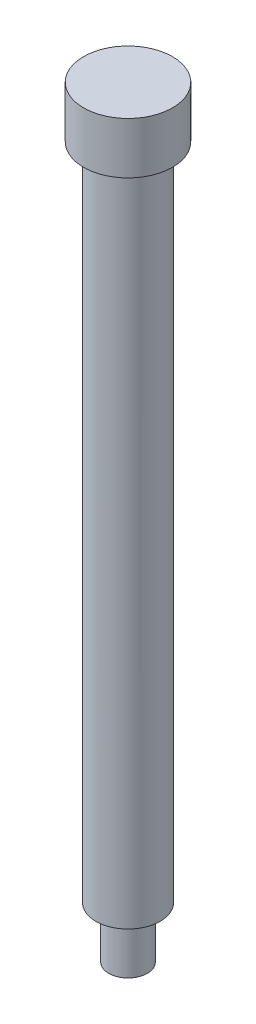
ISO-10303-21;
HEADER;
FILE_DESCRIPTION(('STEP AP214'),'2;1');
FILE_NAME('part.step','',(''),(''),'','','');
FILE_SCHEMA(('AUTOMOTIVE_DESIGN { 1 0 10303 214 1 1 1 1 }'));
ENDSEC;
DATA;
#1=APPLICATION_CONTEXT('core data for automotive mechanical design processes');
#2=APPLICATION_PROTOCOL_DEFINITION('international standard','automotive_design',2000,#1);
#3=PRODUCT_CONTEXT('',#1,'mechanical');
#4=PRODUCT('Part','Part','',(#3));
#5=PRODUCT_RELATED_PRODUCT_CATEGORY('part','',(#4));
#6=PRODUCT_DEFINITION_FORMATION('','',#4);
#7=PRODUCT_DEFINITION_CONTEXT('part definition',#1,'design');
#8=PRODUCT_DEFINITION('design','',#6,#7);
#9=PRODUCT_DEFINITION_SHAPE('','',#8);
#10=(LENGTH_UNIT() NAMED_UNIT(*) SI_UNIT(.MILLI.,.METRE.));
#11=(NAMED_UNIT(*) PLANE_ANGLE_UNIT() SI_UNIT($,.RADIAN.));
#12=(NAMED_UNIT(*) SI_UNIT($,.STERADIAN.) SOLID_ANGLE_UNIT());
#13=UNCERTAINTY_MEASURE_WITH_UNIT(LENGTH_MEASURE(1.E-05),#10,'distance_accuracy_value','');
#14=(GEOMETRIC_REPRESENTATION_CONTEXT(3) GLOBAL_UNCERTAINTY_ASSIGNED_CONTEXT((#13)) GLOBAL_UNIT_ASSIGNED_CONTEXT((#10,
#11,#12)) REPRESENTATION_CONTEXT('',''));
#15=CARTESIAN_POINT('',(0.,0.,0.));
#16=DIRECTION('',(0.,0.,1.));
#17=DIRECTION('',(1.,0.,0.));
#18=AXIS2_PLACEMENT_3D('',#15,#16,#17);
#19=CARTESIAN_POINT('',(0.,310.686117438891,0.));
#20=DIRECTION('',(0.,-1.,0.));
#21=DIRECTION('',(0.,0.,-1.));
#22=AXIS2_PLACEMENT_3D('',#19,#20,#21);
#23=CYLINDRICAL_SURFACE('',#22,7.9375);
#24=CARTESIAN_POINT('',(0.,294.811117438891,0.));
#25=DIRECTION('',(0.,1.,0.));
#26=DIRECTION('',(0.,0.,1.));
#27=AXIS2_PLACEMENT_3D('',#24,#25,#26);
#28=CIRCLE('',#27,7.9375);
#29=CARTESIAN_POINT('',(0.,294.811117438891,7.9375));
#30=VERTEX_POINT('',#29);
#31=EDGE_CURVE('E61',#30,#30,#28,.T.);
#32=ORIENTED_EDGE('',*,*,#31,.T.);
#33=EDGE_LOOP('',(#32));
#34=FACE_BOUND('',#33,.T.);
#35=CARTESIAN_POINT('',(0.,457.371117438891,0.));
#36=DIRECTION('',(0.,-1.,0.));
#37=DIRECTION('',(0.,0.,-1.));
#38=AXIS2_PLACEMENT_3D('',#35,#36,#37);
#39=CIRCLE('',#38,7.9375);
#40=CARTESIAN_POINT('',(0.,457.371117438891,-7.9375));
#41=VERTEX_POINT('',#40);
#42=EDGE_CURVE('E10',#41,#41,#39,.T.);
#43=ORIENTED_EDGE('',*,*,#42,.T.);
#44=EDGE_LOOP('',(#43));
#45=FACE_BOUND('',#44,.T.);
#46=ADVANCED_FACE('F29',(#34,#45),#23,.T.);
#47=CARTESIAN_POINT('',(-10.95375,457.371117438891,0.));
#48=DIRECTION('',(0.,1.,0.));
#49=DIRECTION('',(0.,0.,1.));
#50=AXIS2_PLACEMENT_3D('',#47,#48,#49);
#51=PLANE('',#50);
#52=ORIENTED_EDGE('',*,*,#42,.F.);
#53=EDGE_LOOP('',(#52));
#54=FACE_BOUND('',#53,.T.);
#55=CARTESIAN_POINT('',(0.,457.371117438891,0.));
#56=DIRECTION('',(0.,-1.,0.));
#57=DIRECTION('',(0.,0.,-1.));
#58=AXIS2_PLACEMENT_3D('',#55,#56,#57);
#59=CIRCLE('',#58,10.95375);
#60=CARTESIAN_POINT('',(0.,457.371117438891,-10.95375));
#61=VERTEX_POINT('',#60);
#62=EDGE_CURVE('E36',#61,#61,#59,.T.);
#63=ORIENTED_EDGE('',*,*,#62,.T.);
#64=EDGE_LOOP('',(#63));
#65=FACE_BOUND('',#64,.T.);
#66=ADVANCED_FACE('F101',(#54,#65),#51,.F.);
#67=CARTESIAN_POINT('',(0.,310.686117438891,0.));
#68=DIRECTION('',(0.,-1.,0.));
#69=DIRECTION('',(0.,0.,-1.));
#70=AXIS2_PLACEMENT_3D('',#67,#68,#69);
#71=CYLINDRICAL_SURFACE('',#70,10.95375);
#72=ORIENTED_EDGE('',*,*,#62,.F.);
#73=EDGE_LOOP('',(#72));
#74=FACE_BOUND('',#73,.T.);
#75=CARTESIAN_POINT('',(0.,470.071117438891,0.));
#76=DIRECTION('',(0.,-1.,0.));
#77=DIRECTION('',(0.,0.,-1.));
#78=AXIS2_PLACEMENT_3D('',#75,#76,#77);
#79=CIRCLE('',#78,10.95375);
#80=CARTESIAN_POINT('',(0.,470.071117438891,-10.95375));
#81=VERTEX_POINT('',#80);
#82=EDGE_CURVE('E40',#81,#81,#79,.T.);
#83=ORIENTED_EDGE('',*,*,#82,.T.);
#84=EDGE_LOOP('',(#83));
#85=FACE_BOUND('',#84,.T.);
#86=ADVANCED_FACE('F105',(#74,#85),#71,.T.);
#87=CARTESIAN_POINT('',(-10.95375,470.071117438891,0.));
#88=DIRECTION('',(0.,-1.,0.));
#89=DIRECTION('',(0.,0.,-1.));
#90=AXIS2_PLACEMENT_3D('',#87,#88,#89);
#91=PLANE('',#90);
#92=ORIENTED_EDGE('',*,*,#82,.F.);
#93=EDGE_LOOP('',(#92));
#94=FACE_BOUND('',#93,.T.);
#95=ADVANCED_FACE('F93',(#94),#91,.F.);
#96=CARTESIAN_POINT('',(0.,472.611117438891,0.));
#97=DIRECTION('',(0.,1.,0.));
#98=DIRECTION('',(0.,0.,1.));
#99=AXIS2_PLACEMENT_3D('',#96,#97,#98);
#100=CYLINDRICAL_SURFACE('',#99,4.7625);
#101=CARTESIAN_POINT('',(0.,292.880717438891,0.));
#102=DIRECTION('',(0.,1.,0.));
#103=DIRECTION('',(0.,0.,1.));
#104=AXIS2_PLACEMENT_3D('',#101,#102,#103);
#105=CIRCLE('',#104,4.7625);
#106=CARTESIAN_POINT('',(0.,292.880717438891,4.7625));
#107=VERTEX_POINT('',#106);
#108=EDGE_CURVE('E49',#107,#107,#105,.T.);
#109=ORIENTED_EDGE('',*,*,#108,.F.);
#110=EDGE_LOOP('',(#109));
#111=FACE_BOUND('',#110,.T.);
#112=CARTESIAN_POINT('',(0.,282.111117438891,0.));
#113=DIRECTION('',(0.,1.,0.));
#114=DIRECTION('',(0.,0.,1.));
#115=AXIS2_PLACEMENT_3D('',#112,#113,#114);
#116=CIRCLE('',#115,4.7625);
#117=CARTESIAN_POINT('',(0.,282.111117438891,4.7625));
#118=VERTEX_POINT('',#117);
#119=EDGE_CURVE('E44',#118,#118,#116,.T.);
#120=ORIENTED_EDGE('',*,*,#119,.T.);
#121=EDGE_LOOP('',(#120));
#122=FACE_BOUND('',#121,.T.);
#123=ADVANCED_FACE('F87',(#111,#122),#100,.T.);
#124=CARTESIAN_POINT('',(0.,293.668117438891,0.));
#125=DIRECTION('',(0.,1.,0.));
#126=DIRECTION('',(0.,0.,1.));
#127=AXIS2_PLACEMENT_3D('',#124,#125,#126);
#128=TOROIDAL_SURFACE('',#127,4.7625,0.787399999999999);
#129=CARTESIAN_POINT('',(0.,293.668117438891,0.));
#130=DIRECTION('',(0.,1.,0.));
#131=DIRECTION('',(0.,0.,1.));
#132=AXIS2_PLACEMENT_3D('',#129,#130,#131);
#133=CIRCLE('',#132,3.9751);
#134=CARTESIAN_POINT('',(0.,293.668117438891,3.9751));
#135=VERTEX_POINT('',#134);
#136=EDGE_CURVE('E52',#135,#135,#133,.T.);
#137=ORIENTED_EDGE('',*,*,#136,.F.);
#138=EDGE_LOOP('',(#137));
#139=FACE_BOUND('',#138,.T.);
#140=ORIENTED_EDGE('',*,*,#108,.T.);
#141=EDGE_LOOP('',(#140));
#142=FACE_BOUND('',#141,.T.);
#143=ADVANCED_FACE('F81',(#139,#142),#128,.F.);
#144=CARTESIAN_POINT('',(0.,472.611117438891,0.));
#145=DIRECTION('',(0.,1.,0.));
#146=DIRECTION('',(0.,0.,1.));
#147=AXIS2_PLACEMENT_3D('',#144,#145,#146);
#148=CYLINDRICAL_SURFACE('',#147,3.9751);
#149=CARTESIAN_POINT('',(0.,294.023717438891,0.));
#150=DIRECTION('',(0.,1.,0.));
#151=DIRECTION('',(0.,0.,1.));
#152=AXIS2_PLACEMENT_3D('',#149,#150,#151);
#153=CIRCLE('',#152,3.9751);
#154=CARTESIAN_POINT('',(0.,294.023717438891,3.9751));
#155=VERTEX_POINT('',#154);
#156=EDGE_CURVE('E55',#155,#155,#153,.T.);
#157=ORIENTED_EDGE('',*,*,#156,.F.);
#158=EDGE_LOOP('',(#157));
#159=FACE_BOUND('',#158,.T.);
#160=ORIENTED_EDGE('',*,*,#136,.T.);
#161=EDGE_LOOP('',(#160));
#162=FACE_BOUND('',#161,.T.);
#163=ADVANCED_FACE('F75',(#159,#162),#148,.T.);
#164=CARTESIAN_POINT('',(0.,294.023717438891,0.));
#165=DIRECTION('',(0.,1.,0.));
#166=DIRECTION('',(0.,0.,1.));
#167=AXIS2_PLACEMENT_3D('',#164,#165,#166);
#168=TOROIDAL_SURFACE('',#167,4.7625,0.787399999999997);
#169=CARTESIAN_POINT('',(0.,294.811117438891,0.));
#170=DIRECTION('',(0.,1.,0.));
#171=DIRECTION('',(0.,0.,1.));
#172=AXIS2_PLACEMENT_3D('',#169,#170,#171);
#173=CIRCLE('',#172,4.7625);
#174=CARTESIAN_POINT('',(0.,294.811117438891,4.7625));
#175=VERTEX_POINT('',#174);
#176=EDGE_CURVE('E58',#175,#175,#173,.T.);
#177=ORIENTED_EDGE('',*,*,#176,.F.);
#178=EDGE_LOOP('',(#177));
#179=FACE_BOUND('',#178,.T.);
#180=ORIENTED_EDGE('',*,*,#156,.T.);
#181=EDGE_LOOP('',(#180));
#182=FACE_BOUND('',#181,.T.);
#183=ADVANCED_FACE('F69',(#179,#182),#168,.F.);
#184=CARTESIAN_POINT('',(-4.7625,294.811117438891,0.));
#185=DIRECTION('',(0.,1.,0.));
#186=DIRECTION('',(0.,0.,1.));
#187=AXIS2_PLACEMENT_3D('',#184,#185,#186);
#188=PLANE('',#187);
#189=ORIENTED_EDGE('',*,*,#31,.F.);
#190=EDGE_LOOP('',(#189));
#191=FACE_BOUND('',#190,.T.);
#192=ORIENTED_EDGE('',*,*,#176,.T.);
#193=EDGE_LOOP('',(#192));
#194=FACE_BOUND('',#193,.T.);
#195=ADVANCED_FACE('F66',(#191,#194),#188,.F.);
#196=CARTESIAN_POINT('',(0.,282.111117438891,0.));
#197=DIRECTION('',(0.,1.,0.));
#198=DIRECTION('',(0.,0.,1.));
#199=AXIS2_PLACEMENT_3D('',#196,#197,#198);
#200=PLANE('',#199);
#201=ORIENTED_EDGE('',*,*,#119,.F.);
#202=EDGE_LOOP('',(#201));
#203=FACE_BOUND('',#202,.T.);
#204=ADVANCED_FACE('F31',(#203),#200,.F.);
#205=CLOSED_SHELL('',(#46,#66,#86,#95,#123,#143,#163,#183,#195,#204));
#206=MANIFOLD_SOLID_BREP('B2',#205);
#207=ADVANCED_BREP_SHAPE_REPRESENTATION('',(#18,#206),#14);
#208=SHAPE_DEFINITION_REPRESENTATION(#9,#207);
ENDSEC;
END-ISO-10303-21;
